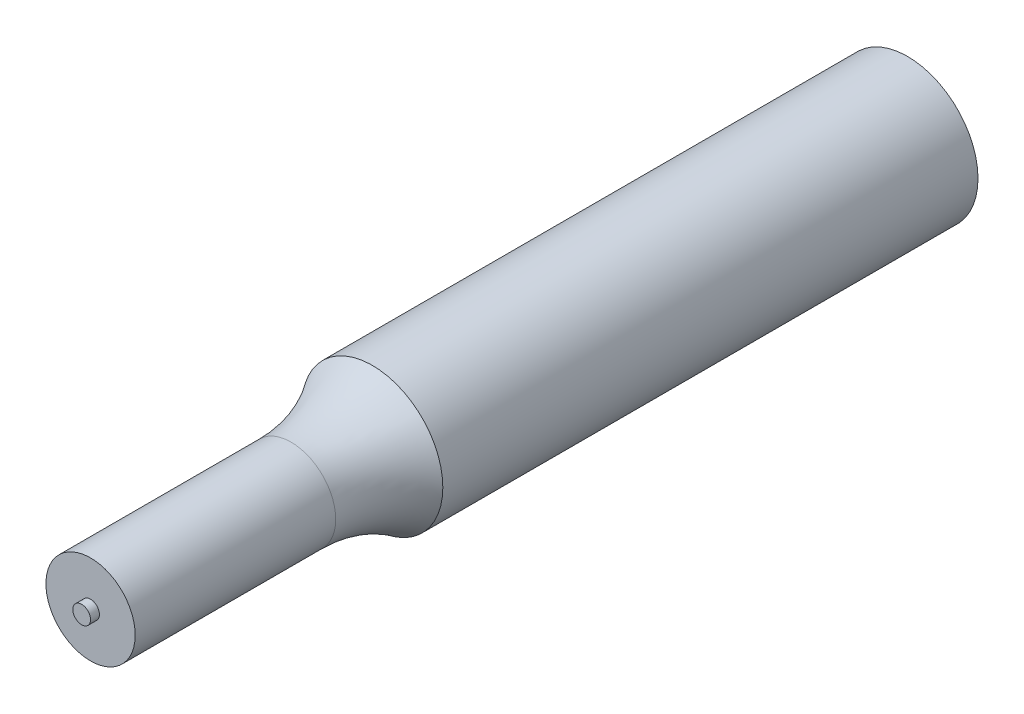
ISO-10303-21;
HEADER;
FILE_DESCRIPTION(('STEP AP214'),'2;1');
FILE_NAME('part.step','',(''),(''),'','','');
FILE_SCHEMA(('AUTOMOTIVE_DESIGN { 1 0 10303 214 1 1 1 1 }'));
ENDSEC;
DATA;
#1=APPLICATION_CONTEXT('core data for automotive mechanical design processes');
#2=APPLICATION_PROTOCOL_DEFINITION('international standard','automotive_design',2000,#1);
#3=PRODUCT_CONTEXT('',#1,'mechanical');
#4=PRODUCT('Part','Part','',(#3));
#5=PRODUCT_RELATED_PRODUCT_CATEGORY('part','',(#4));
#6=PRODUCT_DEFINITION_FORMATION('','',#4);
#7=PRODUCT_DEFINITION_CONTEXT('part definition',#1,'design');
#8=PRODUCT_DEFINITION('design','',#6,#7);
#9=PRODUCT_DEFINITION_SHAPE('','',#8);
#10=(LENGTH_UNIT() NAMED_UNIT(*) SI_UNIT(.MILLI.,.METRE.));
#11=(NAMED_UNIT(*) PLANE_ANGLE_UNIT() SI_UNIT($,.RADIAN.));
#12=(NAMED_UNIT(*) SI_UNIT($,.STERADIAN.) SOLID_ANGLE_UNIT());
#13=UNCERTAINTY_MEASURE_WITH_UNIT(LENGTH_MEASURE(1.E-05),#10,'distance_accuracy_value','');
#14=(GEOMETRIC_REPRESENTATION_CONTEXT(3) GLOBAL_UNCERTAINTY_ASSIGNED_CONTEXT((#13)) GLOBAL_UNIT_ASSIGNED_CONTEXT((#10,
#11,#12)) REPRESENTATION_CONTEXT('',''));
#15=CARTESIAN_POINT('',(0.,0.,0.));
#16=DIRECTION('',(0.,0.,1.));
#17=DIRECTION('',(1.,0.,0.));
#18=AXIS2_PLACEMENT_3D('',#15,#16,#17);
#19=CARTESIAN_POINT('',(-6.34999999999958,1.66533453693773E-12,6.34999999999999));
#20=DIRECTION('',(0.,0.,1.));
#21=DIRECTION('',(1.,0.,0.));
#22=AXIS2_PLACEMENT_3D('',#19,#20,#21);
#23=PLANE('',#22);
#24=CARTESIAN_POINT('',(0.,0.,6.34999999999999));
#25=DIRECTION('',(0.,0.,1.));
#26=DIRECTION('',(1.,0.,0.));
#27=AXIS2_PLACEMENT_3D('',#24,#25,#26);
#28=CIRCLE('',#27,6.35);
#29=CARTESIAN_POINT('',(6.35,0.,6.34999999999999));
#30=VERTEX_POINT('',#29);
#31=EDGE_CURVE('E68',#30,#30,#28,.T.);
#32=ORIENTED_EDGE('',*,*,#31,.F.);
#33=EDGE_LOOP('',(#32));
#34=FACE_BOUND('',#33,.T.);
#35=ADVANCED_FACE('F43',(#34),#23,.F.);
#36=CARTESIAN_POINT('',(0.,0.,43.5171681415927));
#37=DIRECTION('',(0.,0.,1.));
#38=DIRECTION('',(1.,0.,0.));
#39=AXIS2_PLACEMENT_3D('',#36,#37,#38);
#40=CYLINDRICAL_SURFACE('',#39,6.35);
#41=CARTESIAN_POINT('',(-4.84267088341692,-4.1074370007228,25.179099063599));
#42=CARTESIAN_POINT('',(-4.91031116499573,-4.02766520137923,24.7923213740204));
#43=CARTESIAN_POINT('',(-4.97622022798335,-3.94598660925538,24.4056305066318));
#44=CARTESIAN_POINT('',(-5.10457037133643,-3.77849789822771,23.6325148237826));
#45=CARTESIAN_POINT('',(-5.16701100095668,-3.69268724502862,23.246090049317));
#46=CARTESIAN_POINT('',(-5.2886912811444,-3.51621627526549,22.4718534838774));
#47=CARTESIAN_POINT('',(-5.34791420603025,-3.42553473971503,22.0840438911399));
#48=CARTESIAN_POINT('',(-5.46281264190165,-3.2391621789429,21.3091382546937));
#49=CARTESIAN_POINT('',(-5.51848847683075,-3.143471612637,20.9220421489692));
#50=CARTESIAN_POINT('',(-5.62775930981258,-2.9434956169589,20.1381975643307));
#51=CARTESIAN_POINT('',(-5.68125471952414,-2.83904602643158,19.741476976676));
#52=CARTESIAN_POINT('',(-5.78445697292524,-2.62240574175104,18.9495188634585));
#53=CARTESIAN_POINT('',(-5.83416278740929,-2.51021296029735,18.5542817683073));
#54=CARTESIAN_POINT('',(-5.90576107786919,-2.33419370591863,17.9638277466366));
#55=CARTESIAN_POINT('',(-5.92911083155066,-2.27429911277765,17.767614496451));
#56=CARTESIAN_POINT('',(-5.97482827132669,-2.15133460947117,17.3760731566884));
#57=CARTESIAN_POINT('',(-5.99719599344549,-2.08826481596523,17.180745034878));
#58=CARTESIAN_POINT('',(-6.04091673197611,-1.95819561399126,16.7913811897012));
#59=CARTESIAN_POINT('',(-6.06227019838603,-1.89119797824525,16.5973449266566));
#60=CARTESIAN_POINT('',(-6.10393304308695,-1.75208332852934,16.211012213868));
#61=CARTESIAN_POINT('',(-6.12424257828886,-1.6799670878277,16.0187155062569));
#62=CARTESIAN_POINT('',(-6.15380231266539,-1.56675228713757,15.7329471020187));
#63=CARTESIAN_POINT('',(-6.1634724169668,-1.52831758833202,15.63846410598));
#64=CARTESIAN_POINT('',(-6.18252454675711,-1.44932560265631,15.450339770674));
#65=CARTESIAN_POINT('',(-6.19190652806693,-1.40876799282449,15.3566985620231));
#66=CARTESIAN_POINT('',(-6.21036679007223,-1.32502361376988,15.1704738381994));
#67=CARTESIAN_POINT('',(-6.21944483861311,-1.28183490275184,15.0778911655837));
#68=CARTESIAN_POINT('',(-6.23725256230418,-1.19216789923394,14.8943241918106));
#69=CARTESIAN_POINT('',(-6.24598231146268,-1.14569031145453,14.8033395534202));
#70=CARTESIAN_POINT('',(-6.26502899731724,-1.03713912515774,14.6026879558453));
#71=CARTESIAN_POINT('',(-6.27524324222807,-0.973951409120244,14.4935938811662));
#72=CARTESIAN_POINT('',(-6.28993321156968,-0.872007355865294,14.3346767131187));
#73=CARTESIAN_POINT('',(-6.29471851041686,-0.836885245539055,14.2825598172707));
#74=CARTESIAN_POINT('',(-6.3040302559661,-0.763592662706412,14.1805061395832));
#75=CARTESIAN_POINT('',(-6.30855685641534,-0.725424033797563,14.1305680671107));
#76=CARTESIAN_POINT('',(-6.31672426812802,-0.650185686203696,14.039923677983));
#77=CARTESIAN_POINT('',(-6.32040505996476,-0.613575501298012,13.9988438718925));
#78=CARTESIAN_POINT('',(-6.32741951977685,-0.536439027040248,13.9201768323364));
#79=CARTESIAN_POINT('',(-6.33075208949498,-0.495901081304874,13.8826006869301));
#80=CARTESIAN_POINT('',(-6.33694554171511,-0.409326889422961,13.8124695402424));
#81=CARTESIAN_POINT('',(-6.3397969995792,-0.363205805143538,13.7800155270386));
#82=CARTESIAN_POINT('',(-6.34463224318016,-0.265487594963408,13.7248093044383));
#83=CARTESIAN_POINT('',(-6.34662196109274,-0.213931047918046,13.7019907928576));
#84=CARTESIAN_POINT('',(-6.3487550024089,-0.129467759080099,13.67749581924));
#85=CARTESIAN_POINT('',(-6.34932391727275,-0.0979916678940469,13.6709525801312));
#86=CARTESIAN_POINT('',(-6.34998629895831,-0.0343716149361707,13.6633332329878));
#87=CARTESIAN_POINT('',(-6.35008005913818,-0.00222807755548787,13.6622537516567));
#88=CARTESIAN_POINT('',(-6.34978056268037,0.0617275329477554,13.6656997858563));
#89=CARTESIAN_POINT('',(-6.34938755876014,0.0935397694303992,13.6702223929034));
#90=CARTESIAN_POINT('',(-6.3481603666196,0.156013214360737,13.6843262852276));
#91=CARTESIAN_POINT('',(-6.34732566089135,0.186673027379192,13.6939135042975));
#92=CARTESIAN_POINT('',(-6.34482209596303,0.260065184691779,13.7226150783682));
#93=CARTESIAN_POINT('',(-6.34294612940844,0.301858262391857,13.7440834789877));
#94=CARTESIAN_POINT('',(-6.33864739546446,0.381651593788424,13.7930955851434));
#95=CARTESIAN_POINT('',(-6.33622323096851,0.419641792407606,13.8206548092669));
#96=CARTESIAN_POINT('',(-6.33048242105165,0.499390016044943,13.8856462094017));
#97=CARTESIAN_POINT('',(-6.32708403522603,0.540416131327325,13.9239538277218));
#98=CARTESIAN_POINT('',(-6.31991582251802,0.618632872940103,14.0043143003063));
#99=CARTESIAN_POINT('',(-6.31614532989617,0.6558163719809,14.0463738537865));
#100=CARTESIAN_POINT('',(-6.308312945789,0.727315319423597,14.1332452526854));
#101=CARTESIAN_POINT('',(-6.30424941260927,0.76161182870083,14.1780723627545));
#102=CARTESIAN_POINT('',(-6.29591643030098,0.827671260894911,14.2694579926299));
#103=CARTESIAN_POINT('',(-6.29164716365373,0.859436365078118,14.3160149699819));
#104=CARTESIAN_POINT('',(-6.27903822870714,0.948507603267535,14.4526950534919));
#105=CARTESIAN_POINT('',(-6.27047768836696,1.00320772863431,14.5444903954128));
#106=CARTESIAN_POINT('',(-6.25289089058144,1.10753607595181,14.7308978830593));
#107=CARTESIAN_POINT('',(-6.24386430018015,1.15716059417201,14.8255120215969));
#108=CARTESIAN_POINT('',(-6.22540152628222,1.25269619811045,15.0168119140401));
#109=CARTESIAN_POINT('',(-6.21596447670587,1.29859878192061,15.1135018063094));
#110=CARTESIAN_POINT('',(-6.19674163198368,1.38742561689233,15.3082116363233));
#111=CARTESIAN_POINT('',(-6.18695578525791,1.43034942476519,15.4062317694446));
#112=CARTESIAN_POINT('',(-6.15702657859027,1.55595508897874,15.7026425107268));
#113=CARTESIAN_POINT('',(-6.13639643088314,1.63504712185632,15.9025024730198));
#114=CARTESIAN_POINT('',(-6.09399678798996,1.78657264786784,16.3042250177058));
#115=CARTESIAN_POINT('',(-6.07222902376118,1.85901581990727,16.5060841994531));
#116=CARTESIAN_POINT('',(-6.03036939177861,1.99029543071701,16.8860423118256));
#117=CARTESIAN_POINT('',(-6.01040779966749,2.0497012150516,17.0639597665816));
#118=CARTESIAN_POINT('',(-5.96965509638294,2.16552037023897,17.4206719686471));
#119=CARTESIAN_POINT('',(-5.94886396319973,2.22193366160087,17.5994667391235));
#120=CARTESIAN_POINT('',(-5.88526310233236,2.38751102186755,18.1368946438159));
#121=CARTESIAN_POINT('',(-5.8412318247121,2.49299442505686,18.496517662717));
#122=CARTESIAN_POINT('',(-5.74991915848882,2.69692067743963,19.2179005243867));
#123=CARTESIAN_POINT('',(-5.70263308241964,2.79535293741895,19.5796627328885));
#124=CARTESIAN_POINT('',(-5.60490949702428,2.98647037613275,20.3042400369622));
#125=CARTESIAN_POINT('',(-5.5544722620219,3.07915605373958,20.6670550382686));
#126=CARTESIAN_POINT('',(-5.45303116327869,3.25526543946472,21.3755236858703));
#127=CARTESIAN_POINT('',(-5.4021778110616,3.33892049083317,21.7211416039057));
#128=CARTESIAN_POINT('',(-5.29765509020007,3.50239341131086,22.4128681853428));
#129=CARTESIAN_POINT('',(-5.24398564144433,3.58221117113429,22.7589768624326));
#130=CARTESIAN_POINT('',(-5.133987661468,3.73814880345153,23.4506312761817));
#131=CARTESIAN_POINT('',(-5.07766643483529,3.81427778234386,23.7961761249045));
#132=CARTESIAN_POINT('',(-4.96224842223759,3.96326100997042,24.4874897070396));
#133=CARTESIAN_POINT('',(-4.90315177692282,4.03611542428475,24.8332584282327));
#134=CARTESIAN_POINT('',(-4.84267088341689,4.1074370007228,25.179099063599));
#135=B_SPLINE_CURVE_WITH_KNOTS('',3,(#41,#42,#43,#44,#45,#46,#47,#48,#49,#50,#51,#52,#53,#54,
#55,#56,#57,#58,#59,#60,#61,#62,#63,#64,#65,#66,#67,#68,#69,#70,#71,#72,#73,#74,#75,#76,#77,#78,
#79,#80,#81,#82,#83,#84,#85,#86,#87,#88,#89,#90,#91,#92,#93,#94,#95,#96,#97,#98,#99,#100,#101,
#102,#103,#104,#105,#106,#107,#108,#109,#110,#111,#112,#113,#114,#115,#116,#117,#118,#119,#120,
#121,#122,#123,#124,#125,#126,#127,#128,#129,#130,#131,#132,#133,#134),.UNSPECIFIED.,.F.,.F.,(4,
2,2,2,2,2,2,2,2,2,2,2,2,2,2,2,2,2,2,2,2,2,2,2,2,2,2,2,2,2,2,2,2,2,2,2,2,2,2,2,2,2,2,2,2,2,4),
(0.,1.2020042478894,2.40416434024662,3.61207023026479,4.81986564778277,6.06093657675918,
7.30234337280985,7.9217491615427,8.5411322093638,9.16023783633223,9.77925013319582,
10.0866059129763,10.3940085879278,10.7016409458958,11.0092075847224,11.3882604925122,
11.5772698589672,11.7661657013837,11.9314380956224,12.0972169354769,12.2659389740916,
12.4334803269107,12.5295220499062,12.6255044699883,12.7214370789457,12.8174823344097,
12.9577382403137,13.0983557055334,13.2666724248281,13.4352959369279,13.6049511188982,
13.7744584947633,14.0957863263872,14.4173469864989,14.7396226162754,15.0619461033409,
15.7095337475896,16.3561632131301,16.9220256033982,17.4879030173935,18.6198287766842,
19.7534202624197,20.8869132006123,21.9645270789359,23.0421716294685,24.1170039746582,
25.1917819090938),.UNSPECIFIED.);
#136=CARTESIAN_POINT('',(-4.84270585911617,-4.10739576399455,25.178899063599));
#137=VERTEX_POINT('',#136);
#138=CARTESIAN_POINT('',(-4.84270585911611,4.1073957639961,25.178899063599));
#139=VERTEX_POINT('',#138);
#140=EDGE_CURVE('E56',#137,#139,#135,.T.);
#141=ORIENTED_EDGE('',*,*,#140,.T.);
#142=CARTESIAN_POINT('',(-4.84274083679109,4.1073545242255,25.178699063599));
#143=CARTESIAN_POINT('',(-4.827785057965,4.12498432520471,25.2642011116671));
#144=CARTESIAN_POINT('',(-4.81391554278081,4.14114605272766,25.3501839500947));
#145=CARTESIAN_POINT('',(-4.78843682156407,4.17058235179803,25.5229713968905));
#146=CARTESIAN_POINT('',(-4.77682752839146,4.18385703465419,25.6097759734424));
#147=CARTESIAN_POINT('',(-4.74552601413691,4.21941907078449,25.8711726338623));
#148=CARTESIAN_POINT('',(-4.72935149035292,4.23745445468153,26.046796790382));
#149=CARTESIAN_POINT('',(-4.70687228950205,4.26240911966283,26.3992920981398));
#150=CARTESIAN_POINT('',(-4.7005595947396,4.26933743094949,26.576162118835));
#151=CARTESIAN_POINT('',(-4.69795117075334,4.27220782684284,26.9300713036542));
#152=CARTESIAN_POINT('',(-4.70165544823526,4.26814990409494,27.1071104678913));
#153=CARTESIAN_POINT('',(-4.71897998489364,4.24898741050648,27.4601380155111));
#154=CARTESIAN_POINT('',(-4.7326022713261,4.23388058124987,27.6361261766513));
#155=CARTESIAN_POINT('',(-4.76937959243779,4.19240808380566,27.9857641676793));
#156=CARTESIAN_POINT('',(-4.79253448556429,4.16604258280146,28.1594140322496));
#157=CARTESIAN_POINT('',(-4.84774007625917,4.10167211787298,28.5032635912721));
#158=CARTESIAN_POINT('',(-4.87979819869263,4.06365743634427,28.6734602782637));
#159=CARTESIAN_POINT('',(-4.95186919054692,3.97551642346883,29.0089658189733));
#160=CARTESIAN_POINT('',(-4.99188180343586,3.92539048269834,29.174274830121));
#161=CARTESIAN_POINT('',(-5.07839446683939,3.81279638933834,29.4976725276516));
#162=CARTESIAN_POINT('',(-5.12485267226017,3.75040684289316,29.6557996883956));
#163=CARTESIAN_POINT('',(-5.22300975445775,3.61245558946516,29.964552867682));
#164=CARTESIAN_POINT('',(-5.27470937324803,3.53689201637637,30.115177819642));
#165=CARTESIAN_POINT('',(-5.38153845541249,3.3721153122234,30.407125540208));
#166=CARTESIAN_POINT('',(-5.43666145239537,3.28292747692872,30.5484648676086));
#167=CARTESIAN_POINT('',(-5.54839270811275,3.09034366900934,30.820358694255));
#168=CARTESIAN_POINT('',(-5.60500013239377,2.98695554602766,30.9509190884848));
#169=CARTESIAN_POINT('',(-5.73575781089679,2.72958441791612,31.2398599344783));
#170=CARTESIAN_POINT('',(-5.80964177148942,2.57006859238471,31.393525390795));
#171=CARTESIAN_POINT('',(-5.94999250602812,2.22586739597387,31.6735119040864));
#172=CARTESIAN_POINT('',(-6.01646933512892,2.04121692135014,31.7998702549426));
#173=CARTESIAN_POINT('',(-6.12661056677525,1.67853475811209,32.0033402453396));
#174=CARTESIAN_POINT('',(-6.17220015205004,1.50364883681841,32.0849920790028));
#175=CARTESIAN_POINT('',(-6.24945896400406,1.14066295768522,32.2212052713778));
#176=CARTESIAN_POINT('',(-6.28113389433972,0.952568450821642,32.2757777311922));
#177=CARTESIAN_POINT('',(-6.32759988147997,0.567245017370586,32.3552820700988));
#178=CARTESIAN_POINT('',(-6.34231672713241,0.369979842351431,32.3800836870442));
#179=CARTESIAN_POINT('',(-6.35303742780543,-0.0264934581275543,32.3981855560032));
#180=CARTESIAN_POINT('',(-6.34904531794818,-0.225701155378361,32.3914926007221));
#181=CARTESIAN_POINT('',(-6.32381747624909,-0.604217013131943,32.348741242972));
#182=CARTESIAN_POINT('',(-6.30392380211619,-0.783881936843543,32.3149677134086));
#183=CARTESIAN_POINT('',(-6.2503543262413,-1.13447691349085,32.2225274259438));
#184=CARTESIAN_POINT('',(-6.21667752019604,-1.30540632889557,32.163858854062));
#185=CARTESIAN_POINT('',(-6.13661815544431,-1.64181908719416,32.0211252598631));
#186=CARTESIAN_POINT('',(-6.08976678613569,-1.80678298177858,31.9361083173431));
#187=CARTESIAN_POINT('',(-5.98761405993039,-2.12092270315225,31.7447907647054));
#188=CARTESIAN_POINT('',(-5.93230913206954,-2.27009181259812,31.6384811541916));
#189=CARTESIAN_POINT('',(-5.80805712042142,-2.57287640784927,31.3900563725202));
#190=CARTESIAN_POINT('',(-5.73831546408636,-2.72370504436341,31.2449535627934));
#191=CARTESIAN_POINT('',(-5.59750190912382,-3.00248431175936,30.934858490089));
#192=CARTESIAN_POINT('',(-5.52642919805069,-3.13042043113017,30.7698537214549));
#193=CARTESIAN_POINT('',(-5.37258921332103,-3.38895441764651,30.3867779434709));
#194=CARTESIAN_POINT('',(-5.29055334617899,-3.51432090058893,30.1648879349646));
#195=CARTESIAN_POINT('',(-5.1375602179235,-3.73443399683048,29.7027754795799));
#196=CARTESIAN_POINT('',(-5.0666102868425,-3.82916039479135,29.4625410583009));
#197=CARTESIAN_POINT('',(-4.96612833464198,-3.95774564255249,29.0680319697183));
#198=CARTESIAN_POINT('',(-4.9314030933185,-4.00077389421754,28.9179624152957));
#199=CARTESIAN_POINT('',(-4.8685378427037,-4.07704497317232,28.6139655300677));
#200=CARTESIAN_POINT('',(-4.84039854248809,-4.11028674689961,28.4600377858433));
#201=CARTESIAN_POINT('',(-4.79137471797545,-4.1673302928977,28.1492190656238));
#202=CARTESIAN_POINT('',(-4.77049440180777,-4.19112659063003,27.9923264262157));
#203=CARTESIAN_POINT('',(-4.73649217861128,-4.22951508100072,27.6765841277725));
#204=CARTESIAN_POINT('',(-4.72337063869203,-4.24410683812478,27.5177343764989));
#205=CARTESIAN_POINT('',(-4.70387409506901,-4.26571477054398,27.1758262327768));
#206=CARTESIAN_POINT('',(-4.69875640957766,-4.27132212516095,26.9926040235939));
#207=CARTESIAN_POINT('',(-4.69926159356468,-4.27076530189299,26.6261810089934));
#208=CARTESIAN_POINT('',(-4.70488591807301,-4.26459952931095,26.4429802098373));
#209=CARTESIAN_POINT('',(-4.72672167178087,-4.2403859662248,26.0778195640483));
#210=CARTESIAN_POINT('',(-4.74294178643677,-4.22232842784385,25.8958608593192));
#211=CARTESIAN_POINT('',(-4.77483486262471,-4.18613195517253,25.6250866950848));
#212=CARTESIAN_POINT('',(-4.78672780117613,-4.17254644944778,25.5351811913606));
#213=CARTESIAN_POINT('',(-4.81293920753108,-4.14228327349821,25.3562452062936));
#214=CARTESIAN_POINT('',(-4.82725776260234,-4.12560549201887,25.2672147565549));
#215=CARTESIAN_POINT('',(-4.84274083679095,-4.10735452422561,25.178699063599));
#216=B_SPLINE_CURVE_WITH_KNOTS('',3,(#142,#143,#144,#145,#146,#147,#148,#149,#150,#151,#152,
#153,#154,#155,#156,#157,#158,#159,#160,#161,#162,#163,#164,#165,#166,#167,#168,#169,#170,#171,
#172,#173,#174,#175,#176,#177,#178,#179,#180,#181,#182,#183,#184,#185,#186,#187,#188,#189,#190,
#191,#192,#193,#194,#195,#196,#197,#198,#199,#200,#201,#202,#203,#204,#205,#206,#207,#208,#209,
#210,#211,#212,#213,#214,#215),.UNSPECIFIED.,.F.,.F.,(4,2,2,2,2,2,2,2,2,2,2,2,2,2,2,2,2,2,2,2,2,
2,2,2,2,2,2,2,2,2,2,2,2,2,2,2,4),(0.,0.265674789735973,0.53133933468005,1.06251621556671,
1.59326102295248,2.12400618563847,2.65485986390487,3.18570565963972,3.71699549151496,
4.24826819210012,4.77624054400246,5.30428774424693,5.83136619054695,6.35815444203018,
7.05583513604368,7.75255688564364,8.34499992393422,8.93719989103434,9.5319816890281,
10.1266352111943,10.675812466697,11.2250297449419,11.7970130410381,12.3692386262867,
13.0286701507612,13.688518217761,14.4888375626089,15.2896838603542,15.7690530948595,
16.2484739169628,16.7281722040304,17.2078931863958,17.7573186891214,18.3068186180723,
18.856769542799,19.1317951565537,19.406830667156),.UNSPECIFIED.);
#217=EDGE_CURVE('E11',#139,#137,#216,.T.);
#218=ORIENTED_EDGE('',*,*,#217,.T.);
#219=EDGE_LOOP('',(#141,#218));
#220=FACE_BOUND('',#219,.T.);
#221=CARTESIAN_POINT('',(0.,0.,54.58333));
#222=DIRECTION('',(0.,0.,1.));
#223=DIRECTION('',(1.,0.,0.));
#224=AXIS2_PLACEMENT_3D('',#221,#222,#223);
#225=CIRCLE('',#224,6.34999999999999);
#226=CARTESIAN_POINT('',(6.34999999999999,0.,54.58333));
#227=VERTEX_POINT('',#226);
#228=EDGE_CURVE('E81',#227,#227,#225,.T.);
#229=ORIENTED_EDGE('',*,*,#228,.F.);
#230=EDGE_LOOP('',(#229));
#231=FACE_BOUND('',#230,.T.);
#232=ORIENTED_EDGE('',*,*,#31,.T.);
#233=EDGE_LOOP('',(#232));
#234=FACE_BOUND('',#233,.T.);
#235=ADVANCED_FACE('F74',(#220,#231,#234),#40,.T.);
#236=CARTESIAN_POINT('',(0.,0.,61.9102258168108));
#237=DIRECTION('',(0.,0.,1.));
#238=DIRECTION('',(1.,0.,0.));
#239=AXIS2_PLACEMENT_3D('',#236,#237,#238);
#240=TOROIDAL_SURFACE('',#239,16.72336,12.7);
#241=CARTESIAN_POINT('',(0.,0.,61.9102258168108));
#242=DIRECTION('',(0.,0.,1.));
#243=DIRECTION('',(1.,0.,0.));
#244=AXIS2_PLACEMENT_3D('',#241,#242,#243);
#245=CIRCLE('',#244,4.02335999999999);
#246=CARTESIAN_POINT('',(4.02335999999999,0.,61.9102258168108));
#247=VERTEX_POINT('',#246);
#248=EDGE_CURVE('E89',#247,#247,#245,.T.);
#249=ORIENTED_EDGE('',*,*,#248,.F.);
#250=EDGE_LOOP('',(#249));
#251=FACE_BOUND('',#250,.T.);
#252=ORIENTED_EDGE('',*,*,#228,.T.);
#253=EDGE_LOOP('',(#252));
#254=FACE_BOUND('',#253,.T.);
#255=ADVANCED_FACE('F77',(#251,#254),#240,.F.);
#256=CARTESIAN_POINT('',(0.,0.,43.5171681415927));
#257=DIRECTION('',(0.,0.,1.));
#258=DIRECTION('',(1.,0.,0.));
#259=AXIS2_PLACEMENT_3D('',#256,#257,#258);
#260=CYLINDRICAL_SURFACE('',#259,4.02335999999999);
#261=CARTESIAN_POINT('',(0.,0.,79.98333));
#262=DIRECTION('',(0.,0.,1.));
#263=DIRECTION('',(1.,0.,0.));
#264=AXIS2_PLACEMENT_3D('',#261,#262,#263);
#265=CIRCLE('',#264,4.02335999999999);
#266=CARTESIAN_POINT('',(4.02335999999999,0.,79.98333));
#267=VERTEX_POINT('',#266);
#268=EDGE_CURVE('E96',#267,#267,#265,.T.);
#269=ORIENTED_EDGE('',*,*,#268,.F.);
#270=EDGE_LOOP('',(#269));
#271=FACE_BOUND('',#270,.T.);
#272=ORIENTED_EDGE('',*,*,#248,.T.);
#273=EDGE_LOOP('',(#272));
#274=FACE_BOUND('',#273,.T.);
#275=ADVANCED_FACE('F120',(#271,#274),#260,.T.);
#276=CARTESIAN_POINT('',(0.,0.,79.98333));
#277=DIRECTION('',(0.,0.,-1.));
#278=DIRECTION('',(-1.,0.,0.));
#279=AXIS2_PLACEMENT_3D('',#276,#277,#278);
#280=PLANE('',#279);
#281=CARTESIAN_POINT('',(0.,0.,79.98333));
#282=DIRECTION('',(0.,0.,-1.));
#283=DIRECTION('',(-1.,0.,0.));
#284=AXIS2_PLACEMENT_3D('',#281,#282,#283);
#285=CIRCLE('',#284,0.800100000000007);
#286=CARTESIAN_POINT('',(-0.800099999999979,0.,79.98333));
#287=VERTEX_POINT('',#286);
#288=EDGE_CURVE('E93',#287,#287,#285,.T.);
#289=ORIENTED_EDGE('',*,*,#288,.T.);
#290=EDGE_LOOP('',(#289));
#291=FACE_BOUND('',#290,.T.);
#292=ORIENTED_EDGE('',*,*,#268,.T.);
#293=EDGE_LOOP('',(#292));
#294=FACE_BOUND('',#293,.T.);
#295=ADVANCED_FACE('F113',(#291,#294),#280,.F.);
#296=CARTESIAN_POINT('',(0.,0.,0.));
#297=DIRECTION('',(0.,0.,-1.));
#298=DIRECTION('',(-1.,0.,0.));
#299=AXIS2_PLACEMENT_3D('',#296,#297,#298);
#300=CYLINDRICAL_SURFACE('',#299,0.800100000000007);
#301=CARTESIAN_POINT('',(0.,0.,80.78343));
#302=DIRECTION('',(0.,0.,-1.));
#303=DIRECTION('',(-1.,0.,0.));
#304=AXIS2_PLACEMENT_3D('',#301,#302,#303);
#305=CIRCLE('',#304,0.800100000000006);
#306=CARTESIAN_POINT('',(-0.800099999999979,0.,80.78343));
#307=VERTEX_POINT('',#306);
#308=EDGE_CURVE('E72',#307,#307,#305,.T.);
#309=ORIENTED_EDGE('',*,*,#308,.T.);
#310=EDGE_LOOP('',(#309));
#311=FACE_BOUND('',#310,.T.);
#312=ORIENTED_EDGE('',*,*,#288,.F.);
#313=EDGE_LOOP('',(#312));
#314=FACE_BOUND('',#313,.T.);
#315=ADVANCED_FACE('F110',(#311,#314),#300,.T.);
#316=CARTESIAN_POINT('',(0.,0.,80.78343));
#317=DIRECTION('',(0.,0.,1.));
#318=DIRECTION('',(1.,0.,0.));
#319=AXIS2_PLACEMENT_3D('',#316,#317,#318);
#320=PLANE('',#319);
#321=ORIENTED_EDGE('',*,*,#308,.F.);
#322=EDGE_LOOP('',(#321));
#323=FACE_BOUND('',#322,.T.);
#324=ADVANCED_FACE('F109',(#323),#320,.T.);
#325=CARTESIAN_POINT('',(-9.39799999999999,0.,26.8224));
#326=DIRECTION('',(0.,0.,-1.));
#327=DIRECTION('',(-1.,0.,0.));
#328=AXIS2_PLACEMENT_3D('',#325,#326,#327);
#329=SPHERICAL_SURFACE('',#328,6.35);
#330=CARTESIAN_POINT('',(-9.39799999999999,0.,25.178899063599));
#331=DIRECTION('',(0.,0.,-1.));
#332=DIRECTION('',(-1.,0.,0.));
#333=AXIS2_PLACEMENT_3D('',#330,#331,#332);
#334=CIRCLE('',#333,6.1336289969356);
#335=EDGE_CURVE('E62',#139,#137,#334,.T.);
#336=ORIENTED_EDGE('',*,*,#335,.T.);
#337=ORIENTED_EDGE('',*,*,#217,.F.);
#338=EDGE_LOOP('',(#336,#337));
#339=FACE_BOUND('',#338,.T.);
#340=ADVANCED_FACE('F70',(#339),#329,.F.);
#341=CARTESIAN_POINT('',(-9.39799999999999,0.,2.28788401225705));
#342=DIRECTION('',(0.,0.,1.));
#343=DIRECTION('',(1.,0.,0.));
#344=AXIS2_PLACEMENT_3D('',#341,#342,#343);
#345=CONICAL_SURFACE('',#344,0.,0.261799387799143);
#346=ORIENTED_EDGE('',*,*,#335,.F.);
#347=ORIENTED_EDGE('',*,*,#140,.F.);
#348=EDGE_LOOP('',(#346,#347));
#349=FACE_BOUND('',#348,.T.);
#350=ADVANCED_FACE('F65',(#349),#345,.F.);
#351=CLOSED_SHELL('',(#35,#235,#255,#275,#295,#315,#324,#340,#350));
#352=MANIFOLD_SOLID_BREP('B2',#351);
#353=ADVANCED_BREP_SHAPE_REPRESENTATION('',(#18,#352),#14);
#354=SHAPE_DEFINITION_REPRESENTATION(#9,#353);
ENDSEC;
END-ISO-10303-21;
